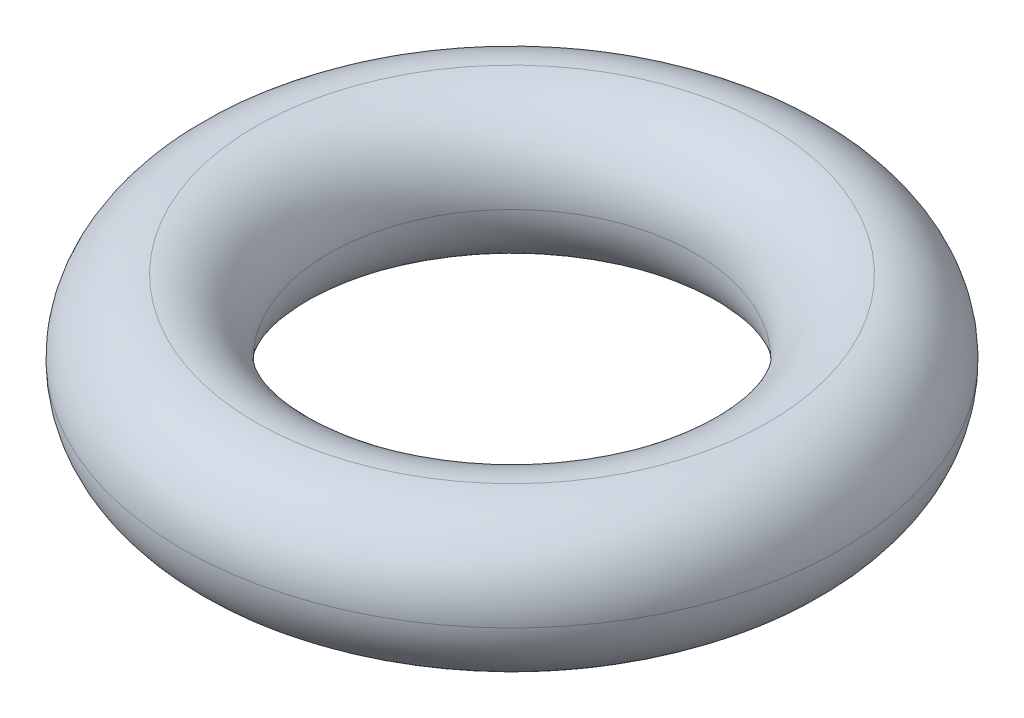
ISO-10303-21;
HEADER;
FILE_DESCRIPTION(('STEP AP214'),'2;1');
FILE_NAME('part.step','',(''),(''),'','','');
FILE_SCHEMA(('AUTOMOTIVE_DESIGN { 1 0 10303 214 1 1 1 1 }'));
ENDSEC;
DATA;
#1=APPLICATION_CONTEXT('core data for automotive mechanical design processes');
#2=APPLICATION_PROTOCOL_DEFINITION('international standard','automotive_design',2000,#1);
#3=PRODUCT_CONTEXT('',#1,'mechanical');
#4=PRODUCT('Part','Part','',(#3));
#5=PRODUCT_RELATED_PRODUCT_CATEGORY('part','',(#4));
#6=PRODUCT_DEFINITION_FORMATION('','',#4);
#7=PRODUCT_DEFINITION_CONTEXT('part definition',#1,'design');
#8=PRODUCT_DEFINITION('design','',#6,#7);
#9=PRODUCT_DEFINITION_SHAPE('','',#8);
#10=(LENGTH_UNIT() NAMED_UNIT(*) SI_UNIT(.MILLI.,.METRE.));
#11=(NAMED_UNIT(*) PLANE_ANGLE_UNIT() SI_UNIT($,.RADIAN.));
#12=(NAMED_UNIT(*) SI_UNIT($,.STERADIAN.) SOLID_ANGLE_UNIT());
#13=UNCERTAINTY_MEASURE_WITH_UNIT(LENGTH_MEASURE(1.E-05),#10,'distance_accuracy_value','');
#14=(GEOMETRIC_REPRESENTATION_CONTEXT(3) GLOBAL_UNCERTAINTY_ASSIGNED_CONTEXT((#13)) GLOBAL_UNIT_ASSIGNED_CONTEXT((#10,
#11,#12)) REPRESENTATION_CONTEXT('',''));
#15=CARTESIAN_POINT('',(0.,0.,0.));
#16=DIRECTION('',(0.,0.,1.));
#17=DIRECTION('',(1.,0.,0.));
#18=AXIS2_PLACEMENT_3D('',#15,#16,#17);
#19=CARTESIAN_POINT('',(0.,3.,0.));
#20=DIRECTION('',(0.,1.,0.));
#21=DIRECTION('',(0.,0.,1.));
#22=AXIS2_PLACEMENT_3D('',#19,#20,#21);
#23=TOROIDAL_SURFACE('',#22,10.5,3.);
#24=CARTESIAN_POINT('',(0.,6.,0.));
#25=DIRECTION('',(0.,1.,0.));
#26=DIRECTION('',(0.,0.,1.));
#27=AXIS2_PLACEMENT_3D('',#24,#25,#26);
#28=CIRCLE('',#27,10.5);
#29=CARTESIAN_POINT('',(0.,6.,10.5));
#30=VERTEX_POINT('',#29);
#31=EDGE_CURVE('E37',#30,#30,#28,.F.);
#32=ORIENTED_EDGE('',*,*,#31,.F.);
#33=EDGE_LOOP('',(#32));
#34=FACE_BOUND('',#33,.T.);
#35=CARTESIAN_POINT('',(0.,3.,0.));
#36=DIRECTION('',(0.,1.,0.));
#37=DIRECTION('',(0.,0.,1.));
#38=AXIS2_PLACEMENT_3D('',#35,#36,#37);
#39=CIRCLE('',#38,7.5);
#40=CARTESIAN_POINT('',(0.,3.,7.5));
#41=VERTEX_POINT('',#40);
#42=EDGE_CURVE('E10',#41,#41,#39,.T.);
#43=ORIENTED_EDGE('',*,*,#42,.F.);
#44=EDGE_LOOP('',(#43));
#45=FACE_BOUND('',#44,.T.);
#46=ADVANCED_FACE('F31',(#34,#45),#23,.T.);
#47=CARTESIAN_POINT('',(0.,3.,0.));
#48=DIRECTION('',(0.,1.,0.));
#49=DIRECTION('',(0.,0.,1.));
#50=AXIS2_PLACEMENT_3D('',#47,#48,#49);
#51=TOROIDAL_SURFACE('',#50,10.5,3.);
#52=ORIENTED_EDGE('',*,*,#42,.T.);
#53=EDGE_LOOP('',(#52));
#54=FACE_BOUND('',#53,.T.);
#55=CARTESIAN_POINT('',(0.,0.,0.));
#56=DIRECTION('',(0.,1.,0.));
#57=DIRECTION('',(0.,0.,1.));
#58=AXIS2_PLACEMENT_3D('',#55,#56,#57);
#59=CIRCLE('',#58,10.5);
#60=CARTESIAN_POINT('',(0.,0.,10.5));
#61=VERTEX_POINT('',#60);
#62=EDGE_CURVE('E41',#61,#61,#59,.T.);
#63=ORIENTED_EDGE('',*,*,#62,.F.);
#64=EDGE_LOOP('',(#63));
#65=FACE_BOUND('',#64,.T.);
#66=ADVANCED_FACE('F55',(#54,#65),#51,.T.);
#67=CARTESIAN_POINT('',(0.,3.,0.));
#68=DIRECTION('',(0.,1.,0.));
#69=DIRECTION('',(0.,0.,1.));
#70=AXIS2_PLACEMENT_3D('',#67,#68,#69);
#71=TOROIDAL_SURFACE('',#70,10.5,3.);
#72=ORIENTED_EDGE('',*,*,#31,.T.);
#73=EDGE_LOOP('',(#72));
#74=FACE_BOUND('',#73,.T.);
#75=CARTESIAN_POINT('',(0.,3.,0.));
#76=DIRECTION('',(0.,1.,0.));
#77=DIRECTION('',(0.,0.,1.));
#78=AXIS2_PLACEMENT_3D('',#75,#76,#77);
#79=CIRCLE('',#78,13.5);
#80=CARTESIAN_POINT('',(0.,3.,13.5));
#81=VERTEX_POINT('',#80);
#82=EDGE_CURVE('E45',#81,#81,#79,.F.);
#83=ORIENTED_EDGE('',*,*,#82,.F.);
#84=EDGE_LOOP('',(#83));
#85=FACE_BOUND('',#84,.T.);
#86=ADVANCED_FACE('F53',(#74,#85),#71,.T.);
#87=CARTESIAN_POINT('',(0.,3.,0.));
#88=DIRECTION('',(0.,1.,0.));
#89=DIRECTION('',(0.,0.,1.));
#90=AXIS2_PLACEMENT_3D('',#87,#88,#89);
#91=TOROIDAL_SURFACE('',#90,10.5,3.);
#92=ORIENTED_EDGE('',*,*,#62,.T.);
#93=EDGE_LOOP('',(#92));
#94=FACE_BOUND('',#93,.T.);
#95=ORIENTED_EDGE('',*,*,#82,.T.);
#96=EDGE_LOOP('',(#95));
#97=FACE_BOUND('',#96,.T.);
#98=ADVANCED_FACE('F51',(#94,#97),#91,.T.);
#99=CLOSED_SHELL('',(#46,#66,#86,#98));
#100=MANIFOLD_SOLID_BREP('B2',#99);
#101=ADVANCED_BREP_SHAPE_REPRESENTATION('',(#18,#100),#14);
#102=SHAPE_DEFINITION_REPRESENTATION(#9,#101);
ENDSEC;
END-ISO-10303-21;
